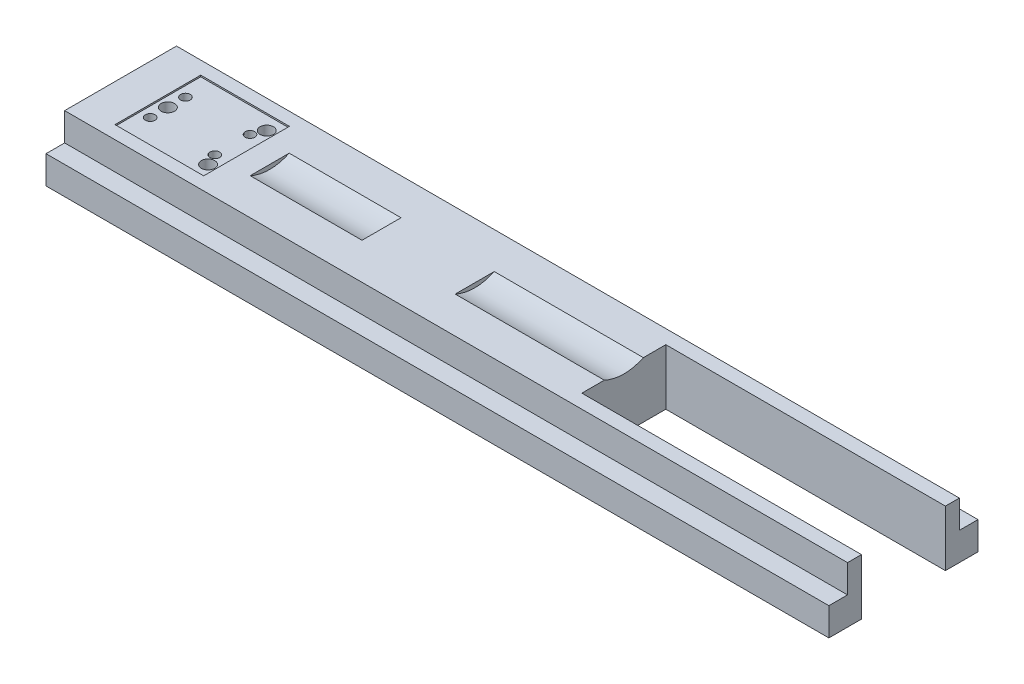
ISO-10303-21;
HEADER;
FILE_DESCRIPTION(('STEP AP214'),'2;1');
FILE_NAME('part.step','',(''),(''),'','','');
FILE_SCHEMA(('AUTOMOTIVE_DESIGN { 1 0 10303 214 1 1 1 1 }'));
ENDSEC;
DATA;
#1=APPLICATION_CONTEXT('core data for automotive mechanical design processes');
#2=APPLICATION_PROTOCOL_DEFINITION('international standard','automotive_design',2000,#1);
#3=PRODUCT_CONTEXT('',#1,'mechanical');
#4=PRODUCT('Part','Part','',(#3));
#5=PRODUCT_RELATED_PRODUCT_CATEGORY('part','',(#4));
#6=PRODUCT_DEFINITION_FORMATION('','',#4);
#7=PRODUCT_DEFINITION_CONTEXT('part definition',#1,'design');
#8=PRODUCT_DEFINITION('design','',#6,#7);
#9=PRODUCT_DEFINITION_SHAPE('','',#8);
#10=(LENGTH_UNIT() NAMED_UNIT(*) SI_UNIT(.MILLI.,.METRE.));
#11=(NAMED_UNIT(*) PLANE_ANGLE_UNIT() SI_UNIT($,.RADIAN.));
#12=(NAMED_UNIT(*) SI_UNIT($,.STERADIAN.) SOLID_ANGLE_UNIT());
#13=UNCERTAINTY_MEASURE_WITH_UNIT(LENGTH_MEASURE(1.E-05),#10,'distance_accuracy_value','');
#14=(GEOMETRIC_REPRESENTATION_CONTEXT(3) GLOBAL_UNCERTAINTY_ASSIGNED_CONTEXT((#13)) GLOBAL_UNIT_ASSIGNED_CONTEXT((#10,
#11,#12)) REPRESENTATION_CONTEXT('',''));
#15=CARTESIAN_POINT('',(0.,0.,0.));
#16=DIRECTION('',(0.,0.,1.));
#17=DIRECTION('',(1.,0.,0.));
#18=AXIS2_PLACEMENT_3D('',#15,#16,#17);
#19=CARTESIAN_POINT('',(0.,0.,0.));
#20=DIRECTION('',(0.,1.,0.));
#21=DIRECTION('',(0.,0.,1.));
#22=AXIS2_PLACEMENT_3D('',#19,#20,#21);
#23=PLANE('',#22);
#24=DIRECTION('',(1.,0.,0.));
#25=VECTOR('',#24,1.);
#26=CARTESIAN_POINT('',(171.45,0.,39.7002));
#27=LINE('',#26,#25);
#28=CARTESIAN_POINT('',(171.45,0.,39.7002));
#29=VERTEX_POINT('',#28);
#30=CARTESIAN_POINT('',(266.7,0.,39.7002));
#31=VERTEX_POINT('',#30);
#32=EDGE_CURVE('E273',#29,#31,#27,.T.);
#33=ORIENTED_EDGE('',*,*,#32,.F.);
#34=DIRECTION('',(0.,0.,1.));
#35=VECTOR('',#34,1.);
#36=CARTESIAN_POINT('',(171.45,0.,39.7002));
#37=LINE('',#36,#35);
#38=CARTESIAN_POINT('',(171.45,0.,32.0477676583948));
#39=VERTEX_POINT('',#38);
#40=EDGE_CURVE('E267',#39,#29,#37,.T.);
#41=ORIENTED_EDGE('',*,*,#40,.F.);
#42=DIRECTION('',(1.,0.,0.));
#43=VECTOR('',#42,1.);
#44=CARTESIAN_POINT('',(120.65,0.,32.0477676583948));
#45=LINE('',#44,#43);
#46=CARTESIAN_POINT('',(120.65,0.,32.0477676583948));
#47=VERTEX_POINT('',#46);
#48=EDGE_CURVE('E409',#47,#39,#45,.T.);
#49=ORIENTED_EDGE('',*,*,#48,.F.);
#50=DIRECTION('',(0.,0.,-1.));
#51=VECTOR('',#50,1.);
#52=CARTESIAN_POINT('',(120.65,0.,0.));
#53=LINE('',#52,#51);
#54=CARTESIAN_POINT('',(120.65,0.,18.7522323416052));
#55=VERTEX_POINT('',#54);
#56=EDGE_CURVE('E412',#47,#55,#53,.T.);
#57=ORIENTED_EDGE('',*,*,#56,.T.);
#58=DIRECTION('',(1.,0.,0.));
#59=VECTOR('',#58,1.);
#60=CARTESIAN_POINT('',(120.65,0.,18.7522323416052));
#61=LINE('',#60,#59);
#62=CARTESIAN_POINT('',(171.45,0.,18.7522323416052));
#63=VERTEX_POINT('',#62);
#64=EDGE_CURVE('E399',#63,#55,#61,.F.);
#65=ORIENTED_EDGE('',*,*,#64,.F.);
#66=CARTESIAN_POINT('',(171.45,0.,11.0998));
#67=VERTEX_POINT('',#66);
#68=EDGE_CURVE('E268',#67,#63,#37,.T.);
#69=ORIENTED_EDGE('',*,*,#68,.F.);
#70=DIRECTION('',(1.,0.,0.));
#71=VECTOR('',#70,1.);
#72=CARTESIAN_POINT('',(171.45,0.,11.0998));
#73=LINE('',#72,#71);
#74=CARTESIAN_POINT('',(266.7,0.,11.0998));
#75=VERTEX_POINT('',#74);
#76=EDGE_CURVE('E276',#67,#75,#73,.T.);
#77=ORIENTED_EDGE('',*,*,#76,.T.);
#78=DIRECTION('',(0.,0.,-1.));
#79=VECTOR('',#78,1.);
#80=CARTESIAN_POINT('',(266.7,0.,0.));
#81=LINE('',#80,#79);
#82=CARTESIAN_POINT('',(266.7,0.,6.35));
#83=VERTEX_POINT('',#82);
#84=EDGE_CURVE('E393',#75,#83,#81,.T.);
#85=ORIENTED_EDGE('',*,*,#84,.T.);
#86=DIRECTION('',(1.,0.,0.));
#87=VECTOR('',#86,1.);
#88=CARTESIAN_POINT('',(0.,0.,6.35));
#89=LINE('',#88,#87);
#90=CARTESIAN_POINT('',(0.,0.,6.35));
#91=VERTEX_POINT('',#90);
#92=EDGE_CURVE('E310',#91,#83,#89,.T.);
#93=ORIENTED_EDGE('',*,*,#92,.F.);
#94=DIRECTION('',(0.,0.,1.));
#95=VECTOR('',#94,1.);
#96=CARTESIAN_POINT('',(0.,0.,0.));
#97=LINE('',#96,#95);
#98=CARTESIAN_POINT('',(0.,0.,44.45));
#99=VERTEX_POINT('',#98);
#100=EDGE_CURVE('E369',#91,#99,#97,.T.);
#101=ORIENTED_EDGE('',*,*,#100,.T.);
#102=DIRECTION('',(1.,0.,0.));
#103=VECTOR('',#102,1.);
#104=CARTESIAN_POINT('',(0.,0.,44.45));
#105=LINE('',#104,#103);
#106=CARTESIAN_POINT('',(266.7,0.,44.45));
#107=VERTEX_POINT('',#106);
#108=EDGE_CURVE('E296',#99,#107,#105,.T.);
#109=ORIENTED_EDGE('',*,*,#108,.T.);
#110=EDGE_CURVE('E380',#107,#31,#81,.T.);
#111=ORIENTED_EDGE('',*,*,#110,.T.);
#112=EDGE_LOOP('',(#33,#41,#49,#57,#65,#69,#77,#85,#93,#101,#109,#111));
#113=FACE_BOUND('',#112,.T.);
#114=DIRECTION('',(0.,0.,1.));
#115=VECTOR('',#114,1.);
#116=CARTESIAN_POINT('',(12.7,0.,40.005));
#117=LINE('',#116,#115);
#118=CARTESIAN_POINT('',(12.7,0.,10.795));
#119=VERTEX_POINT('',#118);
#120=CARTESIAN_POINT('',(12.7,0.,40.005));
#121=VERTEX_POINT('',#120);
#122=EDGE_CURVE('E343',#119,#121,#117,.T.);
#123=ORIENTED_EDGE('',*,*,#122,.F.);
#124=DIRECTION('',(-1.,0.,0.));
#125=VECTOR('',#124,1.);
#126=CARTESIAN_POINT('',(12.7,0.,10.795));
#127=LINE('',#126,#125);
#128=CARTESIAN_POINT('',(42.926,0.,10.795));
#129=VERTEX_POINT('',#128);
#130=EDGE_CURVE('E348',#129,#119,#127,.T.);
#131=ORIENTED_EDGE('',*,*,#130,.F.);
#132=DIRECTION('',(0.,0.,-1.));
#133=VECTOR('',#132,1.);
#134=CARTESIAN_POINT('',(42.926,0.,40.005));
#135=LINE('',#134,#133);
#136=CARTESIAN_POINT('',(42.926,0.,40.005));
#137=VERTEX_POINT('',#136);
#138=EDGE_CURVE('E362',#137,#129,#135,.T.);
#139=ORIENTED_EDGE('',*,*,#138,.F.);
#140=DIRECTION('',(1.,0.,0.));
#141=VECTOR('',#140,1.);
#142=CARTESIAN_POINT('',(12.7,0.,40.005));
#143=LINE('',#142,#141);
#144=EDGE_CURVE('E359',#121,#137,#143,.T.);
#145=ORIENTED_EDGE('',*,*,#144,.F.);
#146=EDGE_LOOP('',(#123,#131,#139,#145));
#147=FACE_BOUND('',#146,.T.);
#148=DIRECTION('',(1.,0.,0.));
#149=VECTOR('',#148,1.);
#150=CARTESIAN_POINT('',(50.8,0.,32.0477676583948));
#151=LINE('',#150,#149);
#152=CARTESIAN_POINT('',(50.8,0.,32.0477676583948));
#153=VERTEX_POINT('',#152);
#154=CARTESIAN_POINT('',(88.9,0.,32.0477676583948));
#155=VERTEX_POINT('',#154);
#156=EDGE_CURVE('E42',#153,#155,#151,.T.);
#157=ORIENTED_EDGE('',*,*,#156,.F.);
#158=DIRECTION('',(0.,0.,-1.));
#159=VECTOR('',#158,1.);
#160=CARTESIAN_POINT('',(50.8,0.,0.));
#161=LINE('',#160,#159);
#162=CARTESIAN_POINT('',(50.8,0.,18.7522323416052));
#163=VERTEX_POINT('',#162);
#164=EDGE_CURVE('E11',#153,#163,#161,.T.);
#165=ORIENTED_EDGE('',*,*,#164,.T.);
#166=DIRECTION('',(1.,0.,0.));
#167=VECTOR('',#166,1.);
#168=CARTESIAN_POINT('',(50.8,0.,18.7522323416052));
#169=LINE('',#168,#167);
#170=CARTESIAN_POINT('',(88.9,0.,18.7522323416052));
#171=VERTEX_POINT('',#170);
#172=EDGE_CURVE('E419',#171,#163,#169,.F.);
#173=ORIENTED_EDGE('',*,*,#172,.F.);
#174=DIRECTION('',(0.,0.,-1.));
#175=VECTOR('',#174,1.);
#176=CARTESIAN_POINT('',(88.9,0.,0.));
#177=LINE('',#176,#175);
#178=EDGE_CURVE('E417',#155,#171,#177,.T.);
#179=ORIENTED_EDGE('',*,*,#178,.F.);
#180=EDGE_LOOP('',(#157,#165,#173,#179));
#181=FACE_BOUND('',#180,.T.);
#182=ADVANCED_FACE('F33',(#113,#147,#181),#23,.T.);
#183=CARTESIAN_POINT('',(266.7,-19.05,0.));
#184=DIRECTION('',(1.,0.,0.));
#185=DIRECTION('',(0.,0.,-1.));
#186=AXIS2_PLACEMENT_3D('',#183,#184,#185);
#187=PLANE('',#186);
#188=DIRECTION('',(0.,-1.,0.));
#189=VECTOR('',#188,1.);
#190=CARTESIAN_POINT('',(266.7,0.,39.7002));
#191=LINE('',#190,#189);
#192=CARTESIAN_POINT('',(266.7,-19.05,39.7002));
#193=VERTEX_POINT('',#192);
#194=EDGE_CURVE('E255',#31,#193,#191,.T.);
#195=ORIENTED_EDGE('',*,*,#194,.F.);
#196=ORIENTED_EDGE('',*,*,#110,.F.);
#197=DIRECTION('',(0.,1.,0.));
#198=VECTOR('',#197,1.);
#199=CARTESIAN_POINT('',(266.7,0.,44.45));
#200=LINE('',#199,#198);
#201=CARTESIAN_POINT('',(266.7,-9.525,44.45));
#202=VERTEX_POINT('',#201);
#203=EDGE_CURVE('E287',#202,#107,#200,.T.);
#204=ORIENTED_EDGE('',*,*,#203,.F.);
#205=DIRECTION('',(0.,0.,-1.));
#206=VECTOR('',#205,1.);
#207=CARTESIAN_POINT('',(266.7,-9.525,50.8));
#208=LINE('',#207,#206);
#209=CARTESIAN_POINT('',(266.7,-9.525,50.8));
#210=VERTEX_POINT('',#209);
#211=EDGE_CURVE('E291',#210,#202,#208,.T.);
#212=ORIENTED_EDGE('',*,*,#211,.F.);
#213=DIRECTION('',(0.,1.,0.));
#214=VECTOR('',#213,1.);
#215=CARTESIAN_POINT('',(266.7,-19.05,50.8));
#216=LINE('',#215,#214);
#217=CARTESIAN_POINT('',(266.7,-19.05,50.8));
#218=VERTEX_POINT('',#217);
#219=EDGE_CURVE('E403',#218,#210,#216,.T.);
#220=ORIENTED_EDGE('',*,*,#219,.F.);
#221=DIRECTION('',(0.,0.,-1.));
#222=VECTOR('',#221,1.);
#223=CARTESIAN_POINT('',(266.7,-19.05,0.));
#224=LINE('',#223,#222);
#225=EDGE_CURVE('E384',#218,#193,#224,.T.);
#226=ORIENTED_EDGE('',*,*,#225,.T.);
#227=EDGE_LOOP('',(#195,#196,#204,#212,#220,#226));
#228=FACE_BOUND('',#227,.T.);
#229=ADVANCED_FACE('F442',(#228),#187,.T.);
#230=CARTESIAN_POINT('',(120.65,13.9954,25.4));
#231=DIRECTION('',(1.,0.,0.));
#232=DIRECTION('',(0.,0.,-1.));
#233=AXIS2_PLACEMENT_3D('',#230,#231,#232);
#234=CYLINDRICAL_SURFACE('',#233,15.494);
#235=CARTESIAN_POINT('',(171.45,13.9954,25.4));
#236=DIRECTION('',(1.,0.,0.));
#237=DIRECTION('',(0.,0.,-1.));
#238=AXIS2_PLACEMENT_3D('',#235,#236,#237);
#239=CIRCLE('',#238,15.494);
#240=EDGE_CURVE('E415',#63,#39,#239,.F.);
#241=ORIENTED_EDGE('',*,*,#240,.F.);
#242=ORIENTED_EDGE('',*,*,#64,.T.);
#243=CARTESIAN_POINT('',(120.65,13.9954,25.4));
#244=DIRECTION('',(1.,0.,0.));
#245=DIRECTION('',(0.,0.,-1.));
#246=AXIS2_PLACEMENT_3D('',#243,#244,#245);
#247=CIRCLE('',#246,15.494);
#248=EDGE_CURVE('E299',#47,#55,#247,.T.);
#249=ORIENTED_EDGE('',*,*,#248,.F.);
#250=ORIENTED_EDGE('',*,*,#48,.T.);
#251=EDGE_LOOP('',(#241,#242,#249,#250));
#252=FACE_BOUND('',#251,.T.);
#253=ADVANCED_FACE('F448',(#252),#234,.F.);
#254=CARTESIAN_POINT('',(0.,-19.05,0.));
#255=DIRECTION('',(-1.,0.,0.));
#256=DIRECTION('',(0.,0.,1.));
#257=AXIS2_PLACEMENT_3D('',#254,#255,#256);
#258=PLANE('',#257);
#259=DIRECTION('',(0.,1.,0.));
#260=VECTOR('',#259,1.);
#261=CARTESIAN_POINT('',(0.,0.,44.45));
#262=LINE('',#261,#260);
#263=CARTESIAN_POINT('',(0.,-9.525,44.45));
#264=VERTEX_POINT('',#263);
#265=EDGE_CURVE('E286',#264,#99,#262,.T.);
#266=ORIENTED_EDGE('',*,*,#265,.T.);
#267=ORIENTED_EDGE('',*,*,#100,.F.);
#268=DIRECTION('',(0.,-1.,0.));
#269=VECTOR('',#268,1.);
#270=CARTESIAN_POINT('',(0.,0.,6.35));
#271=LINE('',#270,#269);
#272=CARTESIAN_POINT('',(0.,-9.525,6.35));
#273=VERTEX_POINT('',#272);
#274=EDGE_CURVE('E303',#91,#273,#271,.T.);
#275=ORIENTED_EDGE('',*,*,#274,.T.);
#276=DIRECTION('',(0.,0.,-1.));
#277=VECTOR('',#276,1.);
#278=CARTESIAN_POINT('',(0.,-9.525,0.));
#279=LINE('',#278,#277);
#280=CARTESIAN_POINT('',(0.,-9.525,0.));
#281=VERTEX_POINT('',#280);
#282=EDGE_CURVE('E306',#273,#281,#279,.T.);
#283=ORIENTED_EDGE('',*,*,#282,.T.);
#284=DIRECTION('',(0.,1.,0.));
#285=VECTOR('',#284,1.);
#286=CARTESIAN_POINT('',(0.,-19.05,0.));
#287=LINE('',#286,#285);
#288=CARTESIAN_POINT('',(0.,-19.05,0.));
#289=VERTEX_POINT('',#288);
#290=EDGE_CURVE('E396',#289,#281,#287,.T.);
#291=ORIENTED_EDGE('',*,*,#290,.F.);
#292=DIRECTION('',(0.,0.,1.));
#293=VECTOR('',#292,1.);
#294=CARTESIAN_POINT('',(0.,-19.05,0.));
#295=LINE('',#294,#293);
#296=CARTESIAN_POINT('',(0.,-19.05,50.8));
#297=VERTEX_POINT('',#296);
#298=EDGE_CURVE('E376',#289,#297,#295,.T.);
#299=ORIENTED_EDGE('',*,*,#298,.T.);
#300=DIRECTION('',(0.,1.,0.));
#301=VECTOR('',#300,1.);
#302=CARTESIAN_POINT('',(0.,-19.05,50.8));
#303=LINE('',#302,#301);
#304=CARTESIAN_POINT('',(0.,-9.525,50.8));
#305=VERTEX_POINT('',#304);
#306=EDGE_CURVE('E390',#297,#305,#303,.T.);
#307=ORIENTED_EDGE('',*,*,#306,.T.);
#308=DIRECTION('',(0.,0.,-1.));
#309=VECTOR('',#308,1.);
#310=CARTESIAN_POINT('',(0.,-9.525,50.8));
#311=LINE('',#310,#309);
#312=EDGE_CURVE('E283',#305,#264,#311,.T.);
#313=ORIENTED_EDGE('',*,*,#312,.T.);
#314=EDGE_LOOP('',(#266,#267,#275,#283,#291,#299,#307,#313));
#315=FACE_BOUND('',#314,.T.);
#316=ADVANCED_FACE('F35',(#315),#258,.T.);
#317=CARTESIAN_POINT('',(0.,-19.05,0.));
#318=DIRECTION('',(0.,0.,-1.));
#319=DIRECTION('',(-1.,0.,0.));
#320=AXIS2_PLACEMENT_3D('',#317,#318,#319);
#321=PLANE('',#320);
#322=DIRECTION('',(1.,0.,0.));
#323=VECTOR('',#322,1.);
#324=CARTESIAN_POINT('',(0.,-9.525,0.));
#325=LINE('',#324,#323);
#326=CARTESIAN_POINT('',(266.7,-9.525,0.));
#327=VERTEX_POINT('',#326);
#328=EDGE_CURVE('E294',#281,#327,#325,.T.);
#329=ORIENTED_EDGE('',*,*,#328,.T.);
#330=DIRECTION('',(0.,1.,0.));
#331=VECTOR('',#330,1.);
#332=CARTESIAN_POINT('',(266.7,-19.05,0.));
#333=LINE('',#332,#331);
#334=CARTESIAN_POINT('',(266.7,-19.05,0.));
#335=VERTEX_POINT('',#334);
#336=EDGE_CURVE('E400',#335,#327,#333,.T.);
#337=ORIENTED_EDGE('',*,*,#336,.F.);
#338=DIRECTION('',(-1.,0.,0.));
#339=VECTOR('',#338,1.);
#340=CARTESIAN_POINT('',(0.,-19.05,0.));
#341=LINE('',#340,#339);
#342=EDGE_CURVE('E387',#335,#289,#341,.T.);
#343=ORIENTED_EDGE('',*,*,#342,.T.);
#344=ORIENTED_EDGE('',*,*,#290,.T.);
#345=EDGE_LOOP('',(#329,#337,#343,#344));
#346=FACE_BOUND('',#345,.T.);
#347=ADVANCED_FACE('F458',(#346),#321,.T.);
#348=DIRECTION('',(0.,1.,0.));
#349=VECTOR('',#348,1.);
#350=CARTESIAN_POINT('',(266.7,0.,11.0998));
#351=LINE('',#350,#349);
#352=CARTESIAN_POINT('',(266.7,-19.05,11.0998));
#353=VERTEX_POINT('',#352);
#354=EDGE_CURVE('E261',#353,#75,#351,.T.);
#355=ORIENTED_EDGE('',*,*,#354,.F.);
#356=EDGE_CURVE('E383',#353,#335,#224,.T.);
#357=ORIENTED_EDGE('',*,*,#356,.T.);
#358=ORIENTED_EDGE('',*,*,#336,.T.);
#359=DIRECTION('',(0.,0.,-1.));
#360=VECTOR('',#359,1.);
#361=CARTESIAN_POINT('',(266.7,-9.525,0.));
#362=LINE('',#361,#360);
#363=CARTESIAN_POINT('',(266.7,-9.525,6.35));
#364=VERTEX_POINT('',#363);
#365=EDGE_CURVE('E307',#364,#327,#362,.T.);
#366=ORIENTED_EDGE('',*,*,#365,.F.);
#367=DIRECTION('',(0.,-1.,0.));
#368=VECTOR('',#367,1.);
#369=CARTESIAN_POINT('',(266.7,0.,6.35));
#370=LINE('',#369,#368);
#371=EDGE_CURVE('E275',#83,#364,#370,.T.);
#372=ORIENTED_EDGE('',*,*,#371,.F.);
#373=ORIENTED_EDGE('',*,*,#84,.F.);
#374=EDGE_LOOP('',(#355,#357,#358,#366,#372,#373));
#375=FACE_BOUND('',#374,.T.);
#376=ADVANCED_FACE('F451',(#375),#187,.T.);
#377=CARTESIAN_POINT('',(0.,-19.05,50.8));
#378=DIRECTION('',(0.,0.,1.));
#379=DIRECTION('',(1.,0.,0.));
#380=AXIS2_PLACEMENT_3D('',#377,#378,#379);
#381=PLANE('',#380);
#382=DIRECTION('',(1.,0.,0.));
#383=VECTOR('',#382,1.);
#384=CARTESIAN_POINT('',(0.,-9.525,50.8));
#385=LINE('',#384,#383);
#386=EDGE_CURVE('E290',#305,#210,#385,.T.);
#387=ORIENTED_EDGE('',*,*,#386,.F.);
#388=ORIENTED_EDGE('',*,*,#306,.F.);
#389=DIRECTION('',(1.,0.,0.));
#390=VECTOR('',#389,1.);
#391=CARTESIAN_POINT('',(0.,-19.05,50.8));
#392=LINE('',#391,#390);
#393=EDGE_CURVE('E379',#297,#218,#392,.T.);
#394=ORIENTED_EDGE('',*,*,#393,.T.);
#395=ORIENTED_EDGE('',*,*,#219,.T.);
#396=EDGE_LOOP('',(#387,#388,#394,#395));
#397=FACE_BOUND('',#396,.T.);
#398=ADVANCED_FACE('F462',(#397),#381,.T.);
#399=CARTESIAN_POINT('',(0.,-19.05,0.));
#400=DIRECTION('',(0.,1.,0.));
#401=DIRECTION('',(0.,0.,1.));
#402=AXIS2_PLACEMENT_3D('',#399,#400,#401);
#403=PLANE('',#402);
#404=DIRECTION('',(1.,0.,0.));
#405=VECTOR('',#404,1.);
#406=CARTESIAN_POINT('',(7.9248,-19.05,7.9248));
#407=LINE('',#406,#405);
#408=CARTESIAN_POINT('',(7.9248,-19.05,7.9248));
#409=VERTEX_POINT('',#408);
#410=CARTESIAN_POINT('',(47.625,-19.05,7.9248));
#411=VERTEX_POINT('',#410);
#412=EDGE_CURVE('E225',#409,#411,#407,.T.);
#413=ORIENTED_EDGE('',*,*,#412,.F.);
#414=DIRECTION('',(0.,0.,-1.));
#415=VECTOR('',#414,1.);
#416=CARTESIAN_POINT('',(7.9248,-19.05,7.9248));
#417=LINE('',#416,#415);
#418=CARTESIAN_POINT('',(7.9248,-19.05,42.8752));
#419=VERTEX_POINT('',#418);
#420=EDGE_CURVE('E49',#419,#409,#417,.T.);
#421=ORIENTED_EDGE('',*,*,#420,.F.);
#422=DIRECTION('',(-1.,0.,0.));
#423=VECTOR('',#422,1.);
#424=CARTESIAN_POINT('',(7.9248,-19.05,42.8752));
#425=LINE('',#424,#423);
#426=CARTESIAN_POINT('',(47.625,-19.05,42.8752));
#427=VERTEX_POINT('',#426);
#428=EDGE_CURVE('E216',#427,#419,#425,.T.);
#429=ORIENTED_EDGE('',*,*,#428,.F.);
#430=DIRECTION('',(0.,0.,1.));
#431=VECTOR('',#430,1.);
#432=CARTESIAN_POINT('',(47.625,-19.05,7.9248));
#433=LINE('',#432,#431);
#434=EDGE_CURVE('E219',#411,#427,#433,.T.);
#435=ORIENTED_EDGE('',*,*,#434,.F.);
#436=EDGE_LOOP('',(#413,#421,#429,#435));
#437=FACE_BOUND('',#436,.T.);
#438=DIRECTION('',(0.,0.,-1.));
#439=VECTOR('',#438,1.);
#440=CARTESIAN_POINT('',(171.45,-19.05,39.7002));
#441=LINE('',#440,#439);
#442=CARTESIAN_POINT('',(171.45,-19.05,39.7002));
#443=VERTEX_POINT('',#442);
#444=CARTESIAN_POINT('',(171.45,-19.05,11.0998));
#445=VERTEX_POINT('',#444);
#446=EDGE_CURVE('E260',#443,#445,#441,.T.);
#447=ORIENTED_EDGE('',*,*,#446,.F.);
#448=DIRECTION('',(1.,0.,0.));
#449=VECTOR('',#448,1.);
#450=CARTESIAN_POINT('',(171.45,-19.05,39.7002));
#451=LINE('',#450,#449);
#452=EDGE_CURVE('E270',#443,#193,#451,.T.);
#453=ORIENTED_EDGE('',*,*,#452,.T.);
#454=ORIENTED_EDGE('',*,*,#225,.F.);
#455=ORIENTED_EDGE('',*,*,#393,.F.);
#456=ORIENTED_EDGE('',*,*,#298,.F.);
#457=ORIENTED_EDGE('',*,*,#342,.F.);
#458=ORIENTED_EDGE('',*,*,#356,.F.);
#459=DIRECTION('',(1.,0.,0.));
#460=VECTOR('',#459,1.);
#461=CARTESIAN_POINT('',(171.45,-19.05,11.0998));
#462=LINE('',#461,#460);
#463=EDGE_CURVE('E279',#445,#353,#462,.T.);
#464=ORIENTED_EDGE('',*,*,#463,.F.);
#465=EDGE_LOOP('',(#447,#453,#454,#455,#456,#457,#458,#464));
#466=FACE_BOUND('',#465,.T.);
#467=ADVANCED_FACE('F456',(#437,#466),#403,.F.);
#468=CARTESIAN_POINT('',(12.7,-0.508,40.005));
#469=DIRECTION('',(-1.,0.,0.));
#470=DIRECTION('',(0.,0.,1.));
#471=AXIS2_PLACEMENT_3D('',#468,#469,#470);
#472=PLANE('',#471);
#473=ORIENTED_EDGE('',*,*,#122,.T.);
#474=DIRECTION('',(0.,1.,0.));
#475=VECTOR('',#474,1.);
#476=CARTESIAN_POINT('',(12.7,-0.508,40.005));
#477=LINE('',#476,#475);
#478=CARTESIAN_POINT('',(12.7,-0.508,40.005));
#479=VERTEX_POINT('',#478);
#480=EDGE_CURVE('E357',#479,#121,#477,.T.);
#481=ORIENTED_EDGE('',*,*,#480,.F.);
#482=DIRECTION('',(0.,0.,1.));
#483=VECTOR('',#482,1.);
#484=CARTESIAN_POINT('',(12.7,-0.508,40.005));
#485=LINE('',#484,#483);
#486=CARTESIAN_POINT('',(12.7,-0.508,10.795));
#487=VERTEX_POINT('',#486);
#488=EDGE_CURVE('E344',#487,#479,#485,.T.);
#489=ORIENTED_EDGE('',*,*,#488,.F.);
#490=DIRECTION('',(0.,1.,0.));
#491=VECTOR('',#490,1.);
#492=CARTESIAN_POINT('',(12.7,-0.508,10.795));
#493=LINE('',#492,#491);
#494=EDGE_CURVE('E367',#487,#119,#493,.T.);
#495=ORIENTED_EDGE('',*,*,#494,.T.);
#496=EDGE_LOOP('',(#473,#481,#489,#495));
#497=FACE_BOUND('',#496,.T.);
#498=ADVANCED_FACE('F469',(#497),#472,.F.);
#499=CARTESIAN_POINT('',(12.7,-0.508,10.795));
#500=DIRECTION('',(0.,0.,-1.));
#501=DIRECTION('',(-1.,0.,0.));
#502=AXIS2_PLACEMENT_3D('',#499,#500,#501);
#503=PLANE('',#502);
#504=ORIENTED_EDGE('',*,*,#130,.T.);
#505=ORIENTED_EDGE('',*,*,#494,.F.);
#506=DIRECTION('',(-1.,0.,0.));
#507=VECTOR('',#506,1.);
#508=CARTESIAN_POINT('',(12.7,-0.508,10.795));
#509=LINE('',#508,#507);
#510=CARTESIAN_POINT('',(42.926,-0.508,10.795));
#511=VERTEX_POINT('',#510);
#512=EDGE_CURVE('E354',#511,#487,#509,.T.);
#513=ORIENTED_EDGE('',*,*,#512,.F.);
#514=DIRECTION('',(0.,1.,0.));
#515=VECTOR('',#514,1.);
#516=CARTESIAN_POINT('',(42.926,-0.508,10.795));
#517=LINE('',#516,#515);
#518=EDGE_CURVE('E370',#511,#129,#517,.T.);
#519=ORIENTED_EDGE('',*,*,#518,.T.);
#520=EDGE_LOOP('',(#504,#505,#513,#519));
#521=FACE_BOUND('',#520,.T.);
#522=ADVANCED_FACE('F562',(#521),#503,.F.);
#523=CARTESIAN_POINT('',(42.926,-0.508,40.005));
#524=DIRECTION('',(1.,0.,0.));
#525=DIRECTION('',(0.,0.,-1.));
#526=AXIS2_PLACEMENT_3D('',#523,#524,#525);
#527=PLANE('',#526);
#528=ORIENTED_EDGE('',*,*,#138,.T.);
#529=ORIENTED_EDGE('',*,*,#518,.F.);
#530=DIRECTION('',(0.,0.,-1.));
#531=VECTOR('',#530,1.);
#532=CARTESIAN_POINT('',(42.926,-0.508,40.005));
#533=LINE('',#532,#531);
#534=CARTESIAN_POINT('',(42.926,-0.508,40.005));
#535=VERTEX_POINT('',#534);
#536=EDGE_CURVE('E351',#535,#511,#533,.T.);
#537=ORIENTED_EDGE('',*,*,#536,.F.);
#538=DIRECTION('',(0.,1.,0.));
#539=VECTOR('',#538,1.);
#540=CARTESIAN_POINT('',(42.926,-0.508,40.005));
#541=LINE('',#540,#539);
#542=EDGE_CURVE('E372',#535,#137,#541,.T.);
#543=ORIENTED_EDGE('',*,*,#542,.T.);
#544=EDGE_LOOP('',(#528,#529,#537,#543));
#545=FACE_BOUND('',#544,.T.);
#546=ADVANCED_FACE('F565',(#545),#527,.F.);
#547=CARTESIAN_POINT('',(12.7,-0.508,40.005));
#548=DIRECTION('',(0.,0.,1.));
#549=DIRECTION('',(1.,0.,0.));
#550=AXIS2_PLACEMENT_3D('',#547,#548,#549);
#551=PLANE('',#550);
#552=ORIENTED_EDGE('',*,*,#144,.T.);
#553=ORIENTED_EDGE('',*,*,#542,.F.);
#554=DIRECTION('',(1.,0.,0.));
#555=VECTOR('',#554,1.);
#556=CARTESIAN_POINT('',(12.7,-0.508,40.005));
#557=LINE('',#556,#555);
#558=EDGE_CURVE('E347',#479,#535,#557,.T.);
#559=ORIENTED_EDGE('',*,*,#558,.F.);
#560=ORIENTED_EDGE('',*,*,#480,.T.);
#561=EDGE_LOOP('',(#552,#553,#559,#560));
#562=FACE_BOUND('',#561,.T.);
#563=ADVANCED_FACE('F560',(#562),#551,.F.);
#564=CARTESIAN_POINT('',(0.,-0.508,0.));
#565=DIRECTION('',(0.,-1.,0.));
#566=DIRECTION('',(0.,0.,-1.));
#567=AXIS2_PLACEMENT_3D('',#564,#565,#566);
#568=PLANE('',#567);
#569=CARTESIAN_POINT('',(16.1036,-0.508,19.4056));
#570=DIRECTION('',(0.,1.,0.));
#571=DIRECTION('',(0.,0.,1.));
#572=AXIS2_PLACEMENT_3D('',#569,#570,#571);
#573=CIRCLE('',#572,1.651);
#574=CARTESIAN_POINT('',(16.1036,-0.508,21.0566));
#575=VERTEX_POINT('',#574);
#576=EDGE_CURVE('E329',#575,#575,#573,.T.);
#577=ORIENTED_EDGE('',*,*,#576,.F.);
#578=EDGE_LOOP('',(#577));
#579=FACE_BOUND('',#578,.T.);
#580=CARTESIAN_POINT('',(16.1036,-0.508,31.3944));
#581=DIRECTION('',(0.,1.,0.));
#582=DIRECTION('',(0.,0.,1.));
#583=AXIS2_PLACEMENT_3D('',#580,#581,#582);
#584=CIRCLE('',#583,1.651);
#585=CARTESIAN_POINT('',(16.1036,-0.508,33.0454));
#586=VERTEX_POINT('',#585);
#587=EDGE_CURVE('E333',#586,#586,#584,.T.);
#588=ORIENTED_EDGE('',*,*,#587,.F.);
#589=EDGE_LOOP('',(#588));
#590=FACE_BOUND('',#589,.T.);
#591=CARTESIAN_POINT('',(39.8018,-0.508,15.4051));
#592=DIRECTION('',(0.,1.,0.));
#593=DIRECTION('',(0.,0.,1.));
#594=AXIS2_PLACEMENT_3D('',#591,#592,#593);
#595=CIRCLE('',#594,2.286);
#596=CARTESIAN_POINT('',(39.8018,-0.508,17.6911));
#597=VERTEX_POINT('',#596);
#598=EDGE_CURVE('E336',#597,#597,#595,.T.);
#599=ORIENTED_EDGE('',*,*,#598,.F.);
#600=EDGE_LOOP('',(#599));
#601=FACE_BOUND('',#600,.T.);
#602=CARTESIAN_POINT('',(39.8018,-0.508,35.3949));
#603=DIRECTION('',(0.,1.,0.));
#604=DIRECTION('',(0.,0.,1.));
#605=AXIS2_PLACEMENT_3D('',#602,#603,#604);
#606=CIRCLE('',#605,2.28599999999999);
#607=CARTESIAN_POINT('',(39.8018,-0.508,37.6809));
#608=VERTEX_POINT('',#607);
#609=EDGE_CURVE('E326',#608,#608,#606,.T.);
#610=ORIENTED_EDGE('',*,*,#609,.F.);
#611=EDGE_LOOP('',(#610));
#612=FACE_BOUND('',#611,.T.);
#613=CARTESIAN_POINT('',(38.1,-0.508,19.4056));
#614=DIRECTION('',(0.,1.,0.));
#615=DIRECTION('',(0.,0.,1.));
#616=AXIS2_PLACEMENT_3D('',#613,#614,#615);
#617=CIRCLE('',#616,1.651);
#618=CARTESIAN_POINT('',(38.1,-0.508,21.0566));
#619=VERTEX_POINT('',#618);
#620=EDGE_CURVE('E323',#619,#619,#617,.T.);
#621=ORIENTED_EDGE('',*,*,#620,.F.);
#622=EDGE_LOOP('',(#621));
#623=FACE_BOUND('',#622,.T.);
#624=CARTESIAN_POINT('',(38.1,-0.508,31.3944));
#625=DIRECTION('',(0.,1.,0.));
#626=DIRECTION('',(0.,0.,1.));
#627=AXIS2_PLACEMENT_3D('',#624,#625,#626);
#628=CIRCLE('',#627,1.651);
#629=CARTESIAN_POINT('',(38.1,-0.508,33.0454));
#630=VERTEX_POINT('',#629);
#631=EDGE_CURVE('E322',#630,#630,#628,.T.);
#632=ORIENTED_EDGE('',*,*,#631,.F.);
#633=EDGE_LOOP('',(#632));
#634=FACE_BOUND('',#633,.T.);
#635=CARTESIAN_POINT('',(16.1036,-0.508,25.4));
#636=DIRECTION('',(0.,1.,0.));
#637=DIRECTION('',(0.,0.,1.));
#638=AXIS2_PLACEMENT_3D('',#635,#636,#637);
#639=CIRCLE('',#638,2.286);
#640=CARTESIAN_POINT('',(16.1036,-0.508,27.686));
#641=VERTEX_POINT('',#640);
#642=EDGE_CURVE('E332',#641,#641,#639,.T.);
#643=ORIENTED_EDGE('',*,*,#642,.F.);
#644=EDGE_LOOP('',(#643));
#645=FACE_BOUND('',#644,.T.);
#646=ORIENTED_EDGE('',*,*,#488,.T.);
#647=ORIENTED_EDGE('',*,*,#558,.T.);
#648=ORIENTED_EDGE('',*,*,#536,.T.);
#649=ORIENTED_EDGE('',*,*,#512,.T.);
#650=EDGE_LOOP('',(#646,#647,#648,#649));
#651=FACE_BOUND('',#650,.T.);
#652=ADVANCED_FACE('F556',(#579,#590,#601,#612,#623,#634,#645,#651),#568,.F.);
#653=CARTESIAN_POINT('',(16.1036,-19.05,25.4));
#654=DIRECTION('',(0.,1.,0.));
#655=DIRECTION('',(0.,0.,1.));
#656=AXIS2_PLACEMENT_3D('',#653,#654,#655);
#657=CYLINDRICAL_SURFACE('',#656,2.286);
#658=CARTESIAN_POINT('',(16.1036,-15.0876,25.4));
#659=DIRECTION('',(0.,1.,0.));
#660=DIRECTION('',(0.,0.,1.));
#661=AXIS2_PLACEMENT_3D('',#658,#659,#660);
#662=CIRCLE('',#661,2.286);
#663=CARTESIAN_POINT('',(16.1036,-15.0876,27.686));
#664=VERTEX_POINT('',#663);
#665=EDGE_CURVE('E249',#664,#664,#662,.F.);
#666=ORIENTED_EDGE('',*,*,#665,.T.);
#667=EDGE_LOOP('',(#666));
#668=FACE_BOUND('',#667,.T.);
#669=ORIENTED_EDGE('',*,*,#642,.T.);
#670=EDGE_LOOP('',(#669));
#671=FACE_BOUND('',#670,.T.);
#672=ADVANCED_FACE('F538',(#668,#671),#657,.F.);
#673=CARTESIAN_POINT('',(38.1,-19.05,31.3944));
#674=DIRECTION('',(0.,1.,0.));
#675=DIRECTION('',(0.,0.,1.));
#676=AXIS2_PLACEMENT_3D('',#673,#674,#675);
#677=CYLINDRICAL_SURFACE('',#676,1.651);
#678=CARTESIAN_POINT('',(38.1,-15.0876,31.3944));
#679=DIRECTION('',(0.,1.,0.));
#680=DIRECTION('',(0.,0.,1.));
#681=AXIS2_PLACEMENT_3D('',#678,#679,#680);
#682=CIRCLE('',#681,1.651);
#683=CARTESIAN_POINT('',(38.1,-15.0876,33.0454));
#684=VERTEX_POINT('',#683);
#685=EDGE_CURVE('E246',#684,#684,#682,.F.);
#686=ORIENTED_EDGE('',*,*,#685,.T.);
#687=EDGE_LOOP('',(#686));
#688=FACE_BOUND('',#687,.T.);
#689=ORIENTED_EDGE('',*,*,#631,.T.);
#690=EDGE_LOOP('',(#689));
#691=FACE_BOUND('',#690,.T.);
#692=ADVANCED_FACE('F534',(#688,#691),#677,.F.);
#693=CARTESIAN_POINT('',(38.1,-19.05,19.4056));
#694=DIRECTION('',(0.,1.,0.));
#695=DIRECTION('',(0.,0.,1.));
#696=AXIS2_PLACEMENT_3D('',#693,#694,#695);
#697=CYLINDRICAL_SURFACE('',#696,1.651);
#698=CARTESIAN_POINT('',(38.1,-15.0876,19.4056));
#699=DIRECTION('',(0.,1.,0.));
#700=DIRECTION('',(0.,0.,1.));
#701=AXIS2_PLACEMENT_3D('',#698,#699,#700);
#702=CIRCLE('',#701,1.651);
#703=CARTESIAN_POINT('',(38.1,-15.0876,21.0566));
#704=VERTEX_POINT('',#703);
#705=EDGE_CURVE('E243',#704,#704,#702,.F.);
#706=ORIENTED_EDGE('',*,*,#705,.T.);
#707=EDGE_LOOP('',(#706));
#708=FACE_BOUND('',#707,.T.);
#709=ORIENTED_EDGE('',*,*,#620,.T.);
#710=EDGE_LOOP('',(#709));
#711=FACE_BOUND('',#710,.T.);
#712=ADVANCED_FACE('F530',(#708,#711),#697,.F.);
#713=CARTESIAN_POINT('',(39.8018,-19.05,35.3949));
#714=DIRECTION('',(0.,1.,0.));
#715=DIRECTION('',(0.,0.,1.));
#716=AXIS2_PLACEMENT_3D('',#713,#714,#715);
#717=CYLINDRICAL_SURFACE('',#716,2.28599999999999);
#718=CARTESIAN_POINT('',(39.8018,-15.0876,35.3949));
#719=DIRECTION('',(0.,1.,0.));
#720=DIRECTION('',(0.,0.,1.));
#721=AXIS2_PLACEMENT_3D('',#718,#719,#720);
#722=CIRCLE('',#721,2.28599999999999);
#723=CARTESIAN_POINT('',(39.8018,-15.0876,37.6809));
#724=VERTEX_POINT('',#723);
#725=EDGE_CURVE('E240',#724,#724,#722,.F.);
#726=ORIENTED_EDGE('',*,*,#725,.T.);
#727=EDGE_LOOP('',(#726));
#728=FACE_BOUND('',#727,.T.);
#729=ORIENTED_EDGE('',*,*,#609,.T.);
#730=EDGE_LOOP('',(#729));
#731=FACE_BOUND('',#730,.T.);
#732=ADVANCED_FACE('F533',(#728,#731),#717,.F.);
#733=CARTESIAN_POINT('',(39.8018,-19.05,15.4051));
#734=DIRECTION('',(0.,1.,0.));
#735=DIRECTION('',(0.,0.,1.));
#736=AXIS2_PLACEMENT_3D('',#733,#734,#735);
#737=CYLINDRICAL_SURFACE('',#736,2.286);
#738=CARTESIAN_POINT('',(39.8018,-15.0876,15.4051));
#739=DIRECTION('',(0.,1.,0.));
#740=DIRECTION('',(0.,0.,1.));
#741=AXIS2_PLACEMENT_3D('',#738,#739,#740);
#742=CIRCLE('',#741,2.286);
#743=CARTESIAN_POINT('',(39.8018,-15.0876,17.6911));
#744=VERTEX_POINT('',#743);
#745=EDGE_CURVE('E237',#744,#744,#742,.F.);
#746=ORIENTED_EDGE('',*,*,#745,.T.);
#747=EDGE_LOOP('',(#746));
#748=FACE_BOUND('',#747,.T.);
#749=ORIENTED_EDGE('',*,*,#598,.T.);
#750=EDGE_LOOP('',(#749));
#751=FACE_BOUND('',#750,.T.);
#752=ADVANCED_FACE('F546',(#748,#751),#737,.F.);
#753=CARTESIAN_POINT('',(16.1036,-19.05,31.3944));
#754=DIRECTION('',(0.,1.,0.));
#755=DIRECTION('',(0.,0.,1.));
#756=AXIS2_PLACEMENT_3D('',#753,#754,#755);
#757=CYLINDRICAL_SURFACE('',#756,1.651);
#758=CARTESIAN_POINT('',(16.1036,-15.0876,31.3944));
#759=DIRECTION('',(0.,1.,0.));
#760=DIRECTION('',(0.,0.,1.));
#761=AXIS2_PLACEMENT_3D('',#758,#759,#760);
#762=CIRCLE('',#761,1.651);
#763=CARTESIAN_POINT('',(16.1036,-15.0876,33.0454));
#764=VERTEX_POINT('',#763);
#765=EDGE_CURVE('E234',#764,#764,#762,.F.);
#766=ORIENTED_EDGE('',*,*,#765,.T.);
#767=EDGE_LOOP('',(#766));
#768=FACE_BOUND('',#767,.T.);
#769=ORIENTED_EDGE('',*,*,#587,.T.);
#770=EDGE_LOOP('',(#769));
#771=FACE_BOUND('',#770,.T.);
#772=ADVANCED_FACE('F542',(#768,#771),#757,.F.);
#773=CARTESIAN_POINT('',(16.1036,-19.05,19.4056));
#774=DIRECTION('',(0.,1.,0.));
#775=DIRECTION('',(0.,0.,1.));
#776=AXIS2_PLACEMENT_3D('',#773,#774,#775);
#777=CYLINDRICAL_SURFACE('',#776,1.651);
#778=CARTESIAN_POINT('',(16.1036,-15.0876,19.4056));
#779=DIRECTION('',(0.,1.,0.));
#780=DIRECTION('',(0.,0.,1.));
#781=AXIS2_PLACEMENT_3D('',#778,#779,#780);
#782=CIRCLE('',#781,1.651);
#783=CARTESIAN_POINT('',(16.1036,-15.0876,21.0566));
#784=VERTEX_POINT('',#783);
#785=EDGE_CURVE('E37',#784,#784,#782,.F.);
#786=ORIENTED_EDGE('',*,*,#785,.T.);
#787=EDGE_LOOP('',(#786));
#788=FACE_BOUND('',#787,.T.);
#789=ORIENTED_EDGE('',*,*,#576,.T.);
#790=EDGE_LOOP('',(#789));
#791=FACE_BOUND('',#790,.T.);
#792=ADVANCED_FACE('F525',(#788,#791),#777,.F.);
#793=CARTESIAN_POINT('',(120.65,13.9954,25.4));
#794=DIRECTION('',(1.,0.,0.));
#795=DIRECTION('',(0.,0.,-1.));
#796=AXIS2_PLACEMENT_3D('',#793,#794,#795);
#797=PLANE('',#796);
#798=ORIENTED_EDGE('',*,*,#248,.T.);
#799=ORIENTED_EDGE('',*,*,#56,.F.);
#800=EDGE_LOOP('',(#798,#799));
#801=FACE_BOUND('',#800,.T.);
#802=ADVANCED_FACE('F522',(#801),#797,.T.);
#803=CARTESIAN_POINT('',(0.,0.,44.45));
#804=DIRECTION('',(0.,0.,-1.));
#805=DIRECTION('',(-1.,0.,0.));
#806=AXIS2_PLACEMENT_3D('',#803,#804,#805);
#807=PLANE('',#806);
#808=ORIENTED_EDGE('',*,*,#203,.T.);
#809=ORIENTED_EDGE('',*,*,#108,.F.);
#810=ORIENTED_EDGE('',*,*,#265,.F.);
#811=DIRECTION('',(1.,0.,0.));
#812=VECTOR('',#811,1.);
#813=CARTESIAN_POINT('',(0.,-9.525,44.45));
#814=LINE('',#813,#812);
#815=EDGE_CURVE('E300',#264,#202,#814,.T.);
#816=ORIENTED_EDGE('',*,*,#815,.T.);
#817=EDGE_LOOP('',(#808,#809,#810,#816));
#818=FACE_BOUND('',#817,.T.);
#819=ADVANCED_FACE('F504',(#818),#807,.F.);
#820=CARTESIAN_POINT('',(0.,-9.525,50.8));
#821=DIRECTION('',(0.,-1.,0.));
#822=DIRECTION('',(0.,0.,-1.));
#823=AXIS2_PLACEMENT_3D('',#820,#821,#822);
#824=PLANE('',#823);
#825=ORIENTED_EDGE('',*,*,#211,.T.);
#826=ORIENTED_EDGE('',*,*,#815,.F.);
#827=ORIENTED_EDGE('',*,*,#312,.F.);
#828=ORIENTED_EDGE('',*,*,#386,.T.);
#829=EDGE_LOOP('',(#825,#826,#827,#828));
#830=FACE_BOUND('',#829,.T.);
#831=ADVANCED_FACE('F501',(#830),#824,.F.);
#832=CARTESIAN_POINT('',(0.,-9.525,0.));
#833=DIRECTION('',(0.,-1.,0.));
#834=DIRECTION('',(0.,0.,-1.));
#835=AXIS2_PLACEMENT_3D('',#832,#833,#834);
#836=PLANE('',#835);
#837=ORIENTED_EDGE('',*,*,#365,.T.);
#838=ORIENTED_EDGE('',*,*,#328,.F.);
#839=ORIENTED_EDGE('',*,*,#282,.F.);
#840=DIRECTION('',(1.,0.,0.));
#841=VECTOR('',#840,1.);
#842=CARTESIAN_POINT('',(0.,-9.525,6.35));
#843=LINE('',#842,#841);
#844=EDGE_CURVE('E316',#273,#364,#843,.T.);
#845=ORIENTED_EDGE('',*,*,#844,.T.);
#846=EDGE_LOOP('',(#837,#838,#839,#845));
#847=FACE_BOUND('',#846,.T.);
#848=ADVANCED_FACE('F511',(#847),#836,.F.);
#849=CARTESIAN_POINT('',(0.,0.,6.35));
#850=DIRECTION('',(0.,0.,1.));
#851=DIRECTION('',(0.,-1.,0.));
#852=AXIS2_PLACEMENT_3D('',#849,#850,#851);
#853=PLANE('',#852);
#854=ORIENTED_EDGE('',*,*,#371,.T.);
#855=ORIENTED_EDGE('',*,*,#844,.F.);
#856=ORIENTED_EDGE('',*,*,#274,.F.);
#857=ORIENTED_EDGE('',*,*,#92,.T.);
#858=EDGE_LOOP('',(#854,#855,#856,#857));
#859=FACE_BOUND('',#858,.T.);
#860=ADVANCED_FACE('F508',(#859),#853,.F.);
#861=CARTESIAN_POINT('',(171.45,0.,0.));
#862=DIRECTION('',(1.,0.,0.));
#863=DIRECTION('',(0.,0.,-1.));
#864=AXIS2_PLACEMENT_3D('',#861,#862,#863);
#865=PLANE('',#864);
#866=ORIENTED_EDGE('',*,*,#240,.T.);
#867=ORIENTED_EDGE('',*,*,#40,.T.);
#868=DIRECTION('',(0.,-1.,0.));
#869=VECTOR('',#868,1.);
#870=CARTESIAN_POINT('',(171.45,0.,39.7002));
#871=LINE('',#870,#869);
#872=EDGE_CURVE('E257',#29,#443,#871,.T.);
#873=ORIENTED_EDGE('',*,*,#872,.T.);
#874=ORIENTED_EDGE('',*,*,#446,.T.);
#875=DIRECTION('',(0.,1.,0.));
#876=VECTOR('',#875,1.);
#877=CARTESIAN_POINT('',(171.45,0.,11.0998));
#878=LINE('',#877,#876);
#879=EDGE_CURVE('E264',#445,#67,#878,.T.);
#880=ORIENTED_EDGE('',*,*,#879,.T.);
#881=ORIENTED_EDGE('',*,*,#68,.T.);
#882=EDGE_LOOP('',(#866,#867,#873,#874,#880,#881));
#883=FACE_BOUND('',#882,.T.);
#884=ADVANCED_FACE('F492',(#883),#865,.T.);
#885=CARTESIAN_POINT('',(171.45,0.,39.7002));
#886=DIRECTION('',(0.,0.,1.));
#887=DIRECTION('',(1.,0.,0.));
#888=AXIS2_PLACEMENT_3D('',#885,#886,#887);
#889=PLANE('',#888);
#890=ORIENTED_EDGE('',*,*,#194,.T.);
#891=ORIENTED_EDGE('',*,*,#452,.F.);
#892=ORIENTED_EDGE('',*,*,#872,.F.);
#893=ORIENTED_EDGE('',*,*,#32,.T.);
#894=EDGE_LOOP('',(#890,#891,#892,#893));
#895=FACE_BOUND('',#894,.T.);
#896=ADVANCED_FACE('F496',(#895),#889,.F.);
#897=CARTESIAN_POINT('',(171.45,0.,11.0998));
#898=DIRECTION('',(0.,0.,-1.));
#899=DIRECTION('',(-1.,0.,0.));
#900=AXIS2_PLACEMENT_3D('',#897,#898,#899);
#901=PLANE('',#900);
#902=ORIENTED_EDGE('',*,*,#354,.T.);
#903=ORIENTED_EDGE('',*,*,#76,.F.);
#904=ORIENTED_EDGE('',*,*,#879,.F.);
#905=ORIENTED_EDGE('',*,*,#463,.T.);
#906=EDGE_LOOP('',(#902,#903,#904,#905));
#907=FACE_BOUND('',#906,.T.);
#908=ADVANCED_FACE('F489',(#907),#901,.F.);
#909=CARTESIAN_POINT('',(50.8,13.9954,25.4));
#910=DIRECTION('',(1.,0.,0.));
#911=DIRECTION('',(0.,0.,-1.));
#912=AXIS2_PLACEMENT_3D('',#909,#910,#911);
#913=CYLINDRICAL_SURFACE('',#912,15.494);
#914=ORIENTED_EDGE('',*,*,#156,.T.);
#915=CARTESIAN_POINT('',(88.9,13.9954,25.4));
#916=DIRECTION('',(1.,0.,0.));
#917=DIRECTION('',(0.,0.,-1.));
#918=AXIS2_PLACEMENT_3D('',#915,#916,#917);
#919=CIRCLE('',#918,15.494);
#920=EDGE_CURVE('E56',#155,#171,#919,.T.);
#921=ORIENTED_EDGE('',*,*,#920,.T.);
#922=ORIENTED_EDGE('',*,*,#172,.T.);
#923=CARTESIAN_POINT('',(50.8,13.9954,25.4));
#924=DIRECTION('',(1.,0.,0.));
#925=DIRECTION('',(0.,0.,-1.));
#926=AXIS2_PLACEMENT_3D('',#923,#924,#925);
#927=CIRCLE('',#926,15.494);
#928=EDGE_CURVE('E252',#153,#163,#927,.T.);
#929=ORIENTED_EDGE('',*,*,#928,.F.);
#930=EDGE_LOOP('',(#914,#921,#922,#929));
#931=FACE_BOUND('',#930,.T.);
#932=ADVANCED_FACE('F425',(#931),#913,.F.);
#933=CARTESIAN_POINT('',(50.8,13.9954,25.4));
#934=DIRECTION('',(1.,0.,0.));
#935=DIRECTION('',(0.,0.,-1.));
#936=AXIS2_PLACEMENT_3D('',#933,#934,#935);
#937=PLANE('',#936);
#938=ORIENTED_EDGE('',*,*,#928,.T.);
#939=ORIENTED_EDGE('',*,*,#164,.F.);
#940=EDGE_LOOP('',(#938,#939));
#941=FACE_BOUND('',#940,.T.);
#942=ADVANCED_FACE('F430',(#941),#937,.T.);
#943=CARTESIAN_POINT('',(88.9,13.9954,25.4));
#944=DIRECTION('',(1.,0.,0.));
#945=DIRECTION('',(0.,0.,-1.));
#946=AXIS2_PLACEMENT_3D('',#943,#944,#945);
#947=PLANE('',#946);
#948=ORIENTED_EDGE('',*,*,#178,.T.);
#949=ORIENTED_EDGE('',*,*,#920,.F.);
#950=EDGE_LOOP('',(#948,#949));
#951=FACE_BOUND('',#950,.T.);
#952=ADVANCED_FACE('F428',(#951),#947,.F.);
#953=CARTESIAN_POINT('',(0.,-15.0876,0.));
#954=DIRECTION('',(0.,1.,0.));
#955=DIRECTION('',(0.,0.,1.));
#956=AXIS2_PLACEMENT_3D('',#953,#954,#955);
#957=PLANE('',#956);
#958=ORIENTED_EDGE('',*,*,#685,.F.);
#959=EDGE_LOOP('',(#958));
#960=FACE_BOUND('',#959,.T.);
#961=ORIENTED_EDGE('',*,*,#725,.F.);
#962=EDGE_LOOP('',(#961));
#963=FACE_BOUND('',#962,.T.);
#964=ORIENTED_EDGE('',*,*,#765,.F.);
#965=EDGE_LOOP('',(#964));
#966=FACE_BOUND('',#965,.T.);
#967=DIRECTION('',(0.,0.,-1.));
#968=VECTOR('',#967,1.);
#969=CARTESIAN_POINT('',(7.9248,-15.0876,7.9248));
#970=LINE('',#969,#968);
#971=CARTESIAN_POINT('',(7.9248,-15.0876,42.8752));
#972=VERTEX_POINT('',#971);
#973=CARTESIAN_POINT('',(7.9248,-15.0876,7.9248));
#974=VERTEX_POINT('',#973);
#975=EDGE_CURVE('E197',#972,#974,#970,.T.);
#976=ORIENTED_EDGE('',*,*,#975,.T.);
#977=DIRECTION('',(1.,0.,0.));
#978=VECTOR('',#977,1.);
#979=CARTESIAN_POINT('',(7.9248,-15.0876,7.9248));
#980=LINE('',#979,#978);
#981=CARTESIAN_POINT('',(47.625,-15.0876,7.9248));
#982=VERTEX_POINT('',#981);
#983=EDGE_CURVE('E206',#974,#982,#980,.T.);
#984=ORIENTED_EDGE('',*,*,#983,.T.);
#985=DIRECTION('',(0.,0.,1.));
#986=VECTOR('',#985,1.);
#987=CARTESIAN_POINT('',(47.625,-15.0876,7.9248));
#988=LINE('',#987,#986);
#989=CARTESIAN_POINT('',(47.625,-15.0876,42.8752));
#990=VERTEX_POINT('',#989);
#991=EDGE_CURVE('E211',#982,#990,#988,.T.);
#992=ORIENTED_EDGE('',*,*,#991,.T.);
#993=DIRECTION('',(-1.,0.,0.));
#994=VECTOR('',#993,1.);
#995=CARTESIAN_POINT('',(7.9248,-15.0876,42.8752));
#996=LINE('',#995,#994);
#997=EDGE_CURVE('E203',#990,#972,#996,.T.);
#998=ORIENTED_EDGE('',*,*,#997,.T.);
#999=EDGE_LOOP('',(#976,#984,#992,#998));
#1000=FACE_BOUND('',#999,.T.);
#1001=ORIENTED_EDGE('',*,*,#785,.F.);
#1002=EDGE_LOOP('',(#1001));
#1003=FACE_BOUND('',#1002,.T.);
#1004=ORIENTED_EDGE('',*,*,#745,.F.);
#1005=EDGE_LOOP('',(#1004));
#1006=FACE_BOUND('',#1005,.T.);
#1007=ORIENTED_EDGE('',*,*,#705,.F.);
#1008=EDGE_LOOP('',(#1007));
#1009=FACE_BOUND('',#1008,.T.);
#1010=ORIENTED_EDGE('',*,*,#665,.F.);
#1011=EDGE_LOOP('',(#1010));
#1012=FACE_BOUND('',#1011,.T.);
#1013=ADVANCED_FACE('F213',(#960,#963,#966,#1000,#1003,#1006,#1009,#1012),#957,.F.);
#1014=CARTESIAN_POINT('',(7.9248,-15.0876,7.9248));
#1015=DIRECTION('',(-1.,0.,0.));
#1016=DIRECTION('',(0.,0.,1.));
#1017=AXIS2_PLACEMENT_3D('',#1014,#1015,#1016);
#1018=PLANE('',#1017);
#1019=ORIENTED_EDGE('',*,*,#420,.T.);
#1020=DIRECTION('',(0.,-1.,0.));
#1021=VECTOR('',#1020,1.);
#1022=CARTESIAN_POINT('',(7.9248,-15.0876,7.9248));
#1023=LINE('',#1022,#1021);
#1024=EDGE_CURVE('E193',#974,#409,#1023,.T.);
#1025=ORIENTED_EDGE('',*,*,#1024,.F.);
#1026=ORIENTED_EDGE('',*,*,#975,.F.);
#1027=DIRECTION('',(0.,-1.,0.));
#1028=VECTOR('',#1027,1.);
#1029=CARTESIAN_POINT('',(7.9248,-15.0876,42.8752));
#1030=LINE('',#1029,#1028);
#1031=EDGE_CURVE('E229',#972,#419,#1030,.T.);
#1032=ORIENTED_EDGE('',*,*,#1031,.T.);
#1033=EDGE_LOOP('',(#1019,#1025,#1026,#1032));
#1034=FACE_BOUND('',#1033,.T.);
#1035=ADVANCED_FACE('F195',(#1034),#1018,.F.);
#1036=CARTESIAN_POINT('',(7.9248,-15.0876,42.8752));
#1037=DIRECTION('',(0.,0.,1.));
#1038=DIRECTION('',(1.,0.,0.));
#1039=AXIS2_PLACEMENT_3D('',#1036,#1037,#1038);
#1040=PLANE('',#1039);
#1041=ORIENTED_EDGE('',*,*,#428,.T.);
#1042=ORIENTED_EDGE('',*,*,#1031,.F.);
#1043=ORIENTED_EDGE('',*,*,#997,.F.);
#1044=DIRECTION('',(0.,-1.,0.));
#1045=VECTOR('',#1044,1.);
#1046=CARTESIAN_POINT('',(47.625,-15.0876,42.8752));
#1047=LINE('',#1046,#1045);
#1048=EDGE_CURVE('E231',#990,#427,#1047,.T.);
#1049=ORIENTED_EDGE('',*,*,#1048,.T.);
#1050=EDGE_LOOP('',(#1041,#1042,#1043,#1049));
#1051=FACE_BOUND('',#1050,.T.);
#1052=ADVANCED_FACE('F781',(#1051),#1040,.F.);
#1053=CARTESIAN_POINT('',(47.625,-15.0876,7.9248));
#1054=DIRECTION('',(1.,0.,0.));
#1055=DIRECTION('',(0.,0.,-1.));
#1056=AXIS2_PLACEMENT_3D('',#1053,#1054,#1055);
#1057=PLANE('',#1056);
#1058=ORIENTED_EDGE('',*,*,#434,.T.);
#1059=ORIENTED_EDGE('',*,*,#1048,.F.);
#1060=ORIENTED_EDGE('',*,*,#991,.F.);
#1061=DIRECTION('',(0.,-1.,0.));
#1062=VECTOR('',#1061,1.);
#1063=CARTESIAN_POINT('',(47.625,-15.0876,7.9248));
#1064=LINE('',#1063,#1062);
#1065=EDGE_CURVE('E202',#982,#411,#1064,.T.);
#1066=ORIENTED_EDGE('',*,*,#1065,.T.);
#1067=EDGE_LOOP('',(#1058,#1059,#1060,#1066));
#1068=FACE_BOUND('',#1067,.T.);
#1069=ADVANCED_FACE('F789',(#1068),#1057,.F.);
#1070=CARTESIAN_POINT('',(7.9248,-15.0876,7.9248));
#1071=DIRECTION('',(0.,0.,-1.));
#1072=DIRECTION('',(-1.,0.,0.));
#1073=AXIS2_PLACEMENT_3D('',#1070,#1071,#1072);
#1074=PLANE('',#1073);
#1075=ORIENTED_EDGE('',*,*,#412,.T.);
#1076=ORIENTED_EDGE('',*,*,#1065,.F.);
#1077=ORIENTED_EDGE('',*,*,#983,.F.);
#1078=ORIENTED_EDGE('',*,*,#1024,.T.);
#1079=EDGE_LOOP('',(#1075,#1076,#1077,#1078));
#1080=FACE_BOUND('',#1079,.T.);
#1081=ADVANCED_FACE('F207',(#1080),#1074,.F.);
#1082=CLOSED_SHELL('',(#182,#229,#253,#316,#347,#376,#398,#467,#498,#522,#546,#563,#652,#672,
#692,#712,#732,#752,#772,#792,#802,#819,#831,#848,#860,#884,#896,#908,#932,#942,#952,#1013,
#1035,#1052,#1069,#1081));
#1083=MANIFOLD_SOLID_BREP('B2',#1082);
#1084=ADVANCED_BREP_SHAPE_REPRESENTATION('',(#18,#1083),#14);
#1085=SHAPE_DEFINITION_REPRESENTATION(#9,#1084);
ENDSEC;
END-ISO-10303-21;
